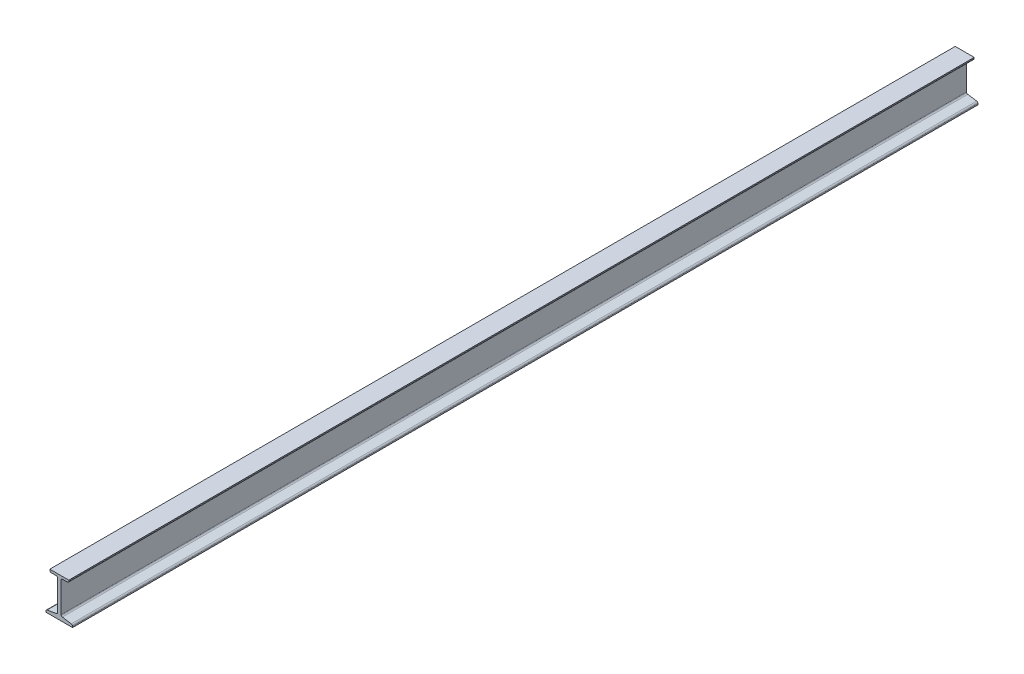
from build123d import *

# Parameters (mm, degrees)
EXTRUSION1_DEPTH = 3000


with BuildPart() as part:
    # Esquisse1 → Extrusion1 (new body)
    with BuildSketch(Plane.XY):
        with BuildLine():
            Line((-44, -40.778060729), (44, -40.778060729))
            Line((44, -40.778060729), (44, -37.048464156))
            ThreePointArc((44, -37.048464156), (42.802029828, -33.801223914), (39.782172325, -32.110022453))
            Line((39.782172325, -32.110022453), (10.217827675, -27.427490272))
            ThreePointArc((10.217827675, -27.427490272), (7.197970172, -25.736288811), (6, -22.489048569))
            Line((6, -22.489048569), (6, 76.221939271))
            ThreePointArc((6, 76.221939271), (7.464466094, 79.757473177), (11, 81.221939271))
            Line((11, 81.221939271), (26.5, 81.221939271))
            ThreePointArc((26.5, 81.221939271), (30.035533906, 82.686405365), (31.5, 86.221939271))
            Line((31.5, 86.221939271), (31.5, 89.221939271))
            Line((31.5, 89.221939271), (-31.5, 89.221939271))
            Line((-31.5, 89.221939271), (-31.5, 86.221939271))
            ThreePointArc((-31.5, 86.221939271), (-30.035533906, 82.686405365), (-26.5, 81.221939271))
            Line((-26.5, 81.221939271), (-11, 81.221939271))
            ThreePointArc((-11, 81.221939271), (-7.464466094, 79.757473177), (-6, 76.221939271))
            Line((-6, 76.221939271), (-6, -22.489048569))
            ThreePointArc((-6, -22.489048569), (-7.197970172, -25.736288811), (-10.217827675, -27.427490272))
            Line((-10.217827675, -27.427490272), (-39.782172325, -32.110022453))
            ThreePointArc((-39.782172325, -32.110022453), (-42.802029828, -33.801223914), (-44, -37.048464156))
            Line((-44, -37.048464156), (-44, -40.778060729))
        make_face()
    extrude(amount=EXTRUSION1_DEPTH)


solid = part.part
